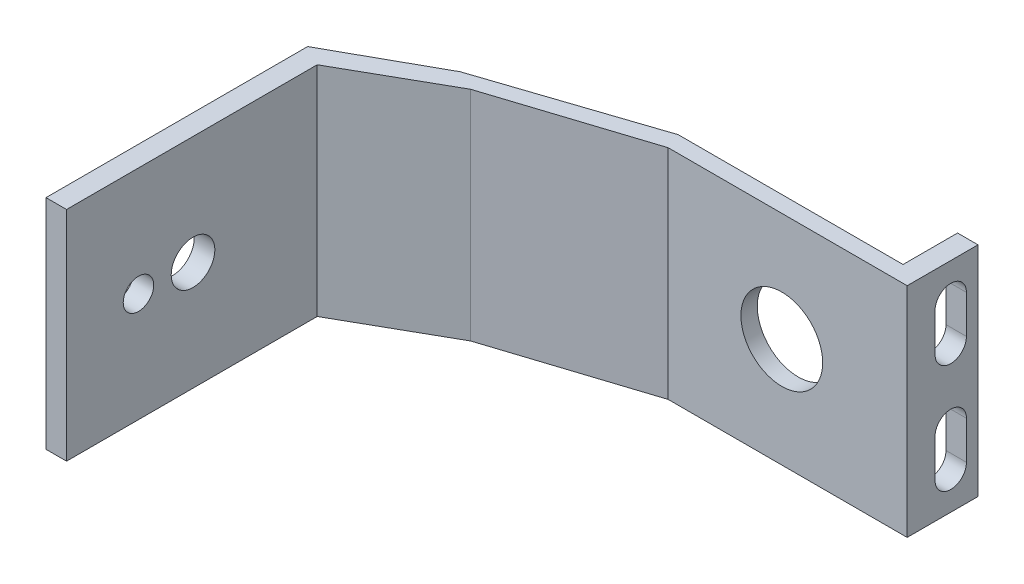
ISO-10303-21;
HEADER;
FILE_DESCRIPTION(('STEP AP214'),'2;1');
FILE_NAME('part.step','',(''),(''),'','','');
FILE_SCHEMA(('AUTOMOTIVE_DESIGN { 1 0 10303 214 1 1 1 1 }'));
ENDSEC;
DATA;
#1=APPLICATION_CONTEXT('core data for automotive mechanical design processes');
#2=APPLICATION_PROTOCOL_DEFINITION('international standard','automotive_design',2000,#1);
#3=PRODUCT_CONTEXT('',#1,'mechanical');
#4=PRODUCT('Part','Part','',(#3));
#5=PRODUCT_RELATED_PRODUCT_CATEGORY('part','',(#4));
#6=PRODUCT_DEFINITION_FORMATION('','',#4);
#7=PRODUCT_DEFINITION_CONTEXT('part definition',#1,'design');
#8=PRODUCT_DEFINITION('design','',#6,#7);
#9=PRODUCT_DEFINITION_SHAPE('','',#8);
#10=(LENGTH_UNIT() NAMED_UNIT(*) SI_UNIT(.MILLI.,.METRE.));
#11=(NAMED_UNIT(*) PLANE_ANGLE_UNIT() SI_UNIT($,.RADIAN.));
#12=(NAMED_UNIT(*) SI_UNIT($,.STERADIAN.) SOLID_ANGLE_UNIT());
#13=UNCERTAINTY_MEASURE_WITH_UNIT(LENGTH_MEASURE(1.E-05),#10,'distance_accuracy_value','');
#14=(GEOMETRIC_REPRESENTATION_CONTEXT(3) GLOBAL_UNCERTAINTY_ASSIGNED_CONTEXT((#13)) GLOBAL_UNIT_ASSIGNED_CONTEXT((#10,
#11,#12)) REPRESENTATION_CONTEXT('',''));
#15=CARTESIAN_POINT('',(0.,0.,0.));
#16=DIRECTION('',(0.,0.,1.));
#17=DIRECTION('',(1.,0.,0.));
#18=AXIS2_PLACEMENT_3D('',#15,#16,#17);
#19=CARTESIAN_POINT('',(0.,25.4,0.));
#20=DIRECTION('',(0.,0.,-1.));
#21=DIRECTION('',(-1.,0.,0.));
#22=AXIS2_PLACEMENT_3D('',#19,#20,#21);
#23=PLANE('',#22);
#24=DIRECTION('',(1.,0.,0.));
#25=VECTOR('',#24,1.);
#26=CARTESIAN_POINT('',(0.,0.,0.));
#27=LINE('',#26,#25);
#28=CARTESIAN_POINT('',(0.,0.,0.));
#29=VERTEX_POINT('',#28);
#30=CARTESIAN_POINT('',(2.39397215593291,0.,0.));
#31=VERTEX_POINT('',#30);
#32=EDGE_CURVE('E245',#29,#31,#27,.T.);
#33=ORIENTED_EDGE('',*,*,#32,.T.);
#34=DIRECTION('',(0.,-1.,0.));
#35=VECTOR('',#34,1.);
#36=CARTESIAN_POINT('',(2.39397215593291,25.4,0.));
#37=LINE('',#36,#35);
#38=CARTESIAN_POINT('',(2.39397215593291,25.4,0.));
#39=VERTEX_POINT('',#38);
#40=EDGE_CURVE('E11',#39,#31,#37,.T.);
#41=ORIENTED_EDGE('',*,*,#40,.F.);
#42=DIRECTION('',(1.,0.,0.));
#43=VECTOR('',#42,1.);
#44=CARTESIAN_POINT('',(0.,25.4,0.));
#45=LINE('',#44,#43);
#46=CARTESIAN_POINT('',(0.,25.4,0.));
#47=VERTEX_POINT('',#46);
#48=EDGE_CURVE('E271',#47,#39,#45,.T.);
#49=ORIENTED_EDGE('',*,*,#48,.F.);
#50=DIRECTION('',(0.,-1.,0.));
#51=VECTOR('',#50,1.);
#52=CARTESIAN_POINT('',(0.,25.4,0.));
#53=LINE('',#52,#51);
#54=EDGE_CURVE('E296',#47,#29,#53,.T.);
#55=ORIENTED_EDGE('',*,*,#54,.T.);
#56=EDGE_LOOP('',(#33,#41,#49,#55));
#57=FACE_BOUND('',#56,.T.);
#58=ADVANCED_FACE('F35',(#57),#23,.F.);
#59=CARTESIAN_POINT('',(2.39397215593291,25.4,0.));
#60=DIRECTION('',(-1.,0.,0.));
#61=DIRECTION('',(0.,0.,1.));
#62=AXIS2_PLACEMENT_3D('',#59,#60,#61);
#63=PLANE('',#62);
#64=CARTESIAN_POINT('',(2.39397215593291,12.7,-8.382));
#65=DIRECTION('',(-1.,0.,0.));
#66=DIRECTION('',(0.,0.,1.));
#67=AXIS2_PLACEMENT_3D('',#64,#65,#66);
#68=CIRCLE('',#67,1.778);
#69=CARTESIAN_POINT('',(2.39397215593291,12.7,-6.604));
#70=VERTEX_POINT('',#69);
#71=EDGE_CURVE('E606',#70,#70,#68,.T.);
#72=ORIENTED_EDGE('',*,*,#71,.T.);
#73=EDGE_LOOP('',(#72));
#74=FACE_BOUND('',#73,.T.);
#75=CARTESIAN_POINT('',(2.39397215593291,12.7,-14.732));
#76=DIRECTION('',(-1.,0.,0.));
#77=DIRECTION('',(0.,0.,1.));
#78=AXIS2_PLACEMENT_3D('',#75,#76,#77);
#79=CIRCLE('',#78,2.54);
#80=CARTESIAN_POINT('',(2.39397215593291,12.7,-12.192));
#81=VERTEX_POINT('',#80);
#82=EDGE_CURVE('E610',#81,#81,#79,.T.);
#83=ORIENTED_EDGE('',*,*,#82,.T.);
#84=EDGE_LOOP('',(#83));
#85=FACE_BOUND('',#84,.T.);
#86=DIRECTION('',(0.,0.,-1.));
#87=VECTOR('',#86,1.);
#88=CARTESIAN_POINT('',(2.39397215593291,0.,0.));
#89=LINE('',#88,#87);
#90=CARTESIAN_POINT('',(2.39397215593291,0.,-29.202694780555));
#91=VERTEX_POINT('',#90);
#92=EDGE_CURVE('E248',#31,#91,#89,.T.);
#93=ORIENTED_EDGE('',*,*,#92,.T.);
#94=DIRECTION('',(0.,-1.,0.));
#95=VECTOR('',#94,1.);
#96=CARTESIAN_POINT('',(2.39397215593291,25.4,-29.202694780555));
#97=LINE('',#96,#95);
#98=CARTESIAN_POINT('',(2.39397215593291,25.4,-29.202694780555));
#99=VERTEX_POINT('',#98);
#100=EDGE_CURVE('E42',#99,#91,#97,.T.);
#101=ORIENTED_EDGE('',*,*,#100,.F.);
#102=DIRECTION('',(0.,0.,-1.));
#103=VECTOR('',#102,1.);
#104=CARTESIAN_POINT('',(2.39397215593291,25.4,0.));
#105=LINE('',#104,#103);
#106=EDGE_CURVE('E274',#39,#99,#105,.T.);
#107=ORIENTED_EDGE('',*,*,#106,.F.);
#108=ORIENTED_EDGE('',*,*,#40,.T.);
#109=EDGE_LOOP('',(#93,#101,#107,#108));
#110=FACE_BOUND('',#109,.T.);
#111=ADVANCED_FACE('F352',(#74,#85,#110),#63,.F.);
#112=CARTESIAN_POINT('',(2.39397215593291,25.4,-29.202694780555));
#113=DIRECTION('',(-0.49301257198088,0.,-0.870022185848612));
#114=DIRECTION('',(-0.870022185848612,0.,0.49301257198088));
#115=AXIS2_PLACEMENT_3D('',#112,#113,#114);
#116=PLANE('',#115);
#117=DIRECTION('',(0.870022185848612,0.,-0.49301257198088));
#118=VECTOR('',#117,1.);
#119=CARTESIAN_POINT('',(2.39397215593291,0.,-29.202694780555));
#120=LINE('',#119,#118);
#121=CARTESIAN_POINT('',(13.8036061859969,0.,-35.6681540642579));
#122=VERTEX_POINT('',#121);
#123=EDGE_CURVE('E250',#91,#122,#120,.T.);
#124=ORIENTED_EDGE('',*,*,#123,.T.);
#125=DIRECTION('',(0.,-1.,0.));
#126=VECTOR('',#125,1.);
#127=CARTESIAN_POINT('',(13.8036061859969,25.4,-35.6681540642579));
#128=LINE('',#127,#126);
#129=CARTESIAN_POINT('',(13.8036061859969,25.4,-35.6681540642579));
#130=VERTEX_POINT('',#129);
#131=EDGE_CURVE('E323',#130,#122,#128,.T.);
#132=ORIENTED_EDGE('',*,*,#131,.F.);
#133=DIRECTION('',(0.870022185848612,0.,-0.49301257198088));
#134=VECTOR('',#133,1.);
#135=CARTESIAN_POINT('',(2.39397215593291,25.4,-29.202694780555));
#136=LINE('',#135,#134);
#137=EDGE_CURVE('E276',#99,#130,#136,.T.);
#138=ORIENTED_EDGE('',*,*,#137,.F.);
#139=ORIENTED_EDGE('',*,*,#100,.T.);
#140=EDGE_LOOP('',(#124,#132,#138,#139));
#141=FACE_BOUND('',#140,.T.);
#142=ADVANCED_FACE('F330',(#141),#116,.F.);
#143=CARTESIAN_POINT('',(13.8036061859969,25.4,-35.6681540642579));
#144=DIRECTION('',(-0.306850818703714,0.,-0.951757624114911));
#145=DIRECTION('',(-0.951757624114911,0.,0.306850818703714));
#146=AXIS2_PLACEMENT_3D('',#143,#144,#145);
#147=PLANE('',#146);
#148=DIRECTION('',(0.951757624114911,0.,-0.306850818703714));
#149=VECTOR('',#148,1.);
#150=CARTESIAN_POINT('',(13.8036061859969,0.,-35.6681540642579));
#151=LINE('',#150,#149);
#152=CARTESIAN_POINT('',(31.2032980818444,0.,-41.277890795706));
#153=VERTEX_POINT('',#152);
#154=EDGE_CURVE('E252',#122,#153,#151,.T.);
#155=ORIENTED_EDGE('',*,*,#154,.T.);
#156=DIRECTION('',(0.,-1.,0.));
#157=VECTOR('',#156,1.);
#158=CARTESIAN_POINT('',(31.2032980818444,25.4,-41.277890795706));
#159=LINE('',#158,#157);
#160=CARTESIAN_POINT('',(31.2032980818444,25.4,-41.277890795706));
#161=VERTEX_POINT('',#160);
#162=EDGE_CURVE('E320',#161,#153,#159,.T.);
#163=ORIENTED_EDGE('',*,*,#162,.F.);
#164=DIRECTION('',(0.951757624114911,0.,-0.306850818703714));
#165=VECTOR('',#164,1.);
#166=CARTESIAN_POINT('',(13.8036061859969,25.4,-35.6681540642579));
#167=LINE('',#166,#165);
#168=EDGE_CURVE('E278',#130,#161,#167,.T.);
#169=ORIENTED_EDGE('',*,*,#168,.F.);
#170=ORIENTED_EDGE('',*,*,#131,.T.);
#171=EDGE_LOOP('',(#155,#163,#169,#170));
#172=FACE_BOUND('',#171,.T.);
#173=ADVANCED_FACE('F340',(#172),#147,.F.);
#174=CARTESIAN_POINT('',(59.055,25.4,-41.277890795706));
#175=DIRECTION('',(0.,0.,-1.));
#176=DIRECTION('',(-1.,0.,0.));
#177=AXIS2_PLACEMENT_3D('',#174,#175,#176);
#178=PLANE('',#177);
#179=CARTESIAN_POINT('',(44.45,12.7,-41.277890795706));
#180=DIRECTION('',(0.,0.,-1.));
#181=DIRECTION('',(-1.,0.,0.));
#182=AXIS2_PLACEMENT_3D('',#179,#180,#181);
#183=CIRCLE('',#182,4.76250000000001);
#184=CARTESIAN_POINT('',(39.6875,12.7,-41.277890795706));
#185=VERTEX_POINT('',#184);
#186=EDGE_CURVE('E242',#185,#185,#183,.T.);
#187=ORIENTED_EDGE('',*,*,#186,.T.);
#188=EDGE_LOOP('',(#187));
#189=FACE_BOUND('',#188,.T.);
#190=DIRECTION('',(1.,0.,0.));
#191=VECTOR('',#190,1.);
#192=CARTESIAN_POINT('',(59.055,0.,-41.277890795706));
#193=LINE('',#192,#191);
#194=CARTESIAN_POINT('',(59.055,0.,-41.277890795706));
#195=VERTEX_POINT('',#194);
#196=EDGE_CURVE('E254',#153,#195,#193,.T.);
#197=ORIENTED_EDGE('',*,*,#196,.T.);
#198=DIRECTION('',(0.,-1.,0.));
#199=VECTOR('',#198,1.);
#200=CARTESIAN_POINT('',(59.055,25.4,-41.277890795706));
#201=LINE('',#200,#199);
#202=CARTESIAN_POINT('',(59.055,25.4,-41.277890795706));
#203=VERTEX_POINT('',#202);
#204=EDGE_CURVE('E317',#203,#195,#201,.T.);
#205=ORIENTED_EDGE('',*,*,#204,.F.);
#206=DIRECTION('',(1.,0.,0.));
#207=VECTOR('',#206,1.);
#208=CARTESIAN_POINT('',(59.055,25.4,-41.277890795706));
#209=LINE('',#208,#207);
#210=EDGE_CURVE('E280',#161,#203,#209,.T.);
#211=ORIENTED_EDGE('',*,*,#210,.F.);
#212=ORIENTED_EDGE('',*,*,#162,.T.);
#213=EDGE_LOOP('',(#197,#205,#211,#212));
#214=FACE_BOUND('',#213,.T.);
#215=ADVANCED_FACE('F344',(#189,#214),#178,.F.);
#216=CARTESIAN_POINT('',(59.055,25.4,-43.18));
#217=DIRECTION('',(-1.,0.,0.));
#218=DIRECTION('',(0.,0.,1.));
#219=AXIS2_PLACEMENT_3D('',#216,#217,#218);
#220=PLANE('',#219);
#221=DIRECTION('',(0.,-1.,0.));
#222=VECTOR('',#221,1.);
#223=CARTESIAN_POINT('',(59.055,4.1275,-48.1838));
#224=LINE('',#223,#222);
#225=CARTESIAN_POINT('',(59.055,8.5725,-48.1838));
#226=VERTEX_POINT('',#225);
#227=CARTESIAN_POINT('',(59.055,4.1275,-48.1838));
#228=VERTEX_POINT('',#227);
#229=EDGE_CURVE('E200',#226,#228,#224,.T.);
#230=ORIENTED_EDGE('',*,*,#229,.T.);
#231=CARTESIAN_POINT('',(59.055,4.1275,-46.355));
#232=DIRECTION('',(-1.,0.,0.));
#233=DIRECTION('',(0.,0.,1.));
#234=AXIS2_PLACEMENT_3D('',#231,#232,#233);
#235=CIRCLE('',#234,1.8288);
#236=CARTESIAN_POINT('',(59.055,4.1275,-44.5262));
#237=VERTEX_POINT('',#236);
#238=EDGE_CURVE('E191',#228,#237,#235,.T.);
#239=ORIENTED_EDGE('',*,*,#238,.T.);
#240=DIRECTION('',(0.,1.,0.));
#241=VECTOR('',#240,1.);
#242=CARTESIAN_POINT('',(59.055,4.1275,-44.5262));
#243=LINE('',#242,#241);
#244=CARTESIAN_POINT('',(59.055,8.5725,-44.5262));
#245=VERTEX_POINT('',#244);
#246=EDGE_CURVE('E197',#237,#245,#243,.T.);
#247=ORIENTED_EDGE('',*,*,#246,.T.);
#248=CARTESIAN_POINT('',(59.055,8.5725,-46.355));
#249=DIRECTION('',(-1.,0.,0.));
#250=DIRECTION('',(0.,0.,1.));
#251=AXIS2_PLACEMENT_3D('',#248,#249,#250);
#252=CIRCLE('',#251,1.8288);
#253=EDGE_CURVE('E49',#245,#226,#252,.T.);
#254=ORIENTED_EDGE('',*,*,#253,.T.);
#255=EDGE_LOOP('',(#230,#239,#247,#254));
#256=FACE_BOUND('',#255,.T.);
#257=DIRECTION('',(0.,-1.,0.));
#258=VECTOR('',#257,1.);
#259=CARTESIAN_POINT('',(59.055,16.8275,-48.1838));
#260=LINE('',#259,#258);
#261=CARTESIAN_POINT('',(59.055,21.2725,-48.1838));
#262=VERTEX_POINT('',#261);
#263=CARTESIAN_POINT('',(59.055,16.8275,-48.1838));
#264=VERTEX_POINT('',#263);
#265=EDGE_CURVE('E227',#262,#264,#260,.T.);
#266=ORIENTED_EDGE('',*,*,#265,.T.);
#267=CARTESIAN_POINT('',(59.055,16.8275,-46.355));
#268=DIRECTION('',(-1.,0.,0.));
#269=DIRECTION('',(0.,0.,1.));
#270=AXIS2_PLACEMENT_3D('',#267,#268,#269);
#271=CIRCLE('',#270,1.8288);
#272=CARTESIAN_POINT('',(59.055,16.8275,-44.5262));
#273=VERTEX_POINT('',#272);
#274=EDGE_CURVE('E218',#264,#273,#271,.T.);
#275=ORIENTED_EDGE('',*,*,#274,.T.);
#276=DIRECTION('',(0.,1.,0.));
#277=VECTOR('',#276,1.);
#278=CARTESIAN_POINT('',(59.055,16.8275,-44.5262));
#279=LINE('',#278,#277);
#280=CARTESIAN_POINT('',(59.055,21.2725,-44.5262));
#281=VERTEX_POINT('',#280);
#282=EDGE_CURVE('E221',#273,#281,#279,.T.);
#283=ORIENTED_EDGE('',*,*,#282,.T.);
#284=CARTESIAN_POINT('',(59.055,21.2725,-46.355));
#285=DIRECTION('',(-1.,0.,0.));
#286=DIRECTION('',(0.,0.,1.));
#287=AXIS2_PLACEMENT_3D('',#284,#285,#286);
#288=CIRCLE('',#287,1.8288);
#289=EDGE_CURVE('E224',#281,#262,#288,.T.);
#290=ORIENTED_EDGE('',*,*,#289,.T.);
#291=EDGE_LOOP('',(#266,#275,#283,#290));
#292=FACE_BOUND('',#291,.T.);
#293=DIRECTION('',(0.,0.,-1.));
#294=VECTOR('',#293,1.);
#295=CARTESIAN_POINT('',(59.055,0.,-43.18));
#296=LINE('',#295,#294);
#297=CARTESIAN_POINT('',(59.055,0.,-49.53));
#298=VERTEX_POINT('',#297);
#299=EDGE_CURVE('E257',#195,#298,#296,.T.);
#300=ORIENTED_EDGE('',*,*,#299,.T.);
#301=DIRECTION('',(0.,-1.,0.));
#302=VECTOR('',#301,1.);
#303=CARTESIAN_POINT('',(59.055,25.4,-49.53));
#304=LINE('',#303,#302);
#305=CARTESIAN_POINT('',(59.055,25.4,-49.53));
#306=VERTEX_POINT('',#305);
#307=EDGE_CURVE('E314',#306,#298,#304,.T.);
#308=ORIENTED_EDGE('',*,*,#307,.F.);
#309=DIRECTION('',(0.,0.,-1.));
#310=VECTOR('',#309,1.);
#311=CARTESIAN_POINT('',(59.055,25.4,-43.18));
#312=LINE('',#311,#310);
#313=EDGE_CURVE('E282',#203,#306,#312,.T.);
#314=ORIENTED_EDGE('',*,*,#313,.F.);
#315=ORIENTED_EDGE('',*,*,#204,.T.);
#316=EDGE_LOOP('',(#300,#308,#314,#315));
#317=FACE_BOUND('',#316,.T.);
#318=ADVANCED_FACE('F384',(#256,#292,#317),#220,.F.);
#319=CARTESIAN_POINT('',(59.055,25.4,-49.53));
#320=DIRECTION('',(0.,0.,1.));
#321=DIRECTION('',(1.,0.,0.));
#322=AXIS2_PLACEMENT_3D('',#319,#320,#321);
#323=PLANE('',#322);
#324=DIRECTION('',(-1.,0.,0.));
#325=VECTOR('',#324,1.);
#326=CARTESIAN_POINT('',(59.055,0.,-49.53));
#327=LINE('',#326,#325);
#328=CARTESIAN_POINT('',(56.67375,0.,-49.53));
#329=VERTEX_POINT('',#328);
#330=EDGE_CURVE('E259',#298,#329,#327,.T.);
#331=ORIENTED_EDGE('',*,*,#330,.T.);
#332=DIRECTION('',(0.,-1.,0.));
#333=VECTOR('',#332,1.);
#334=CARTESIAN_POINT('',(56.67375,25.4,-49.53));
#335=LINE('',#334,#333);
#336=CARTESIAN_POINT('',(56.67375,25.4,-49.53));
#337=VERTEX_POINT('',#336);
#338=EDGE_CURVE('E311',#337,#329,#335,.T.);
#339=ORIENTED_EDGE('',*,*,#338,.F.);
#340=DIRECTION('',(-1.,0.,0.));
#341=VECTOR('',#340,1.);
#342=CARTESIAN_POINT('',(59.055,25.4,-49.53));
#343=LINE('',#342,#341);
#344=EDGE_CURVE('E284',#306,#337,#343,.T.);
#345=ORIENTED_EDGE('',*,*,#344,.F.);
#346=ORIENTED_EDGE('',*,*,#307,.T.);
#347=EDGE_LOOP('',(#331,#339,#345,#346));
#348=FACE_BOUND('',#347,.T.);
#349=ADVANCED_FACE('F382',(#348),#323,.F.);
#350=CARTESIAN_POINT('',(56.67375,25.4,-49.53));
#351=DIRECTION('',(1.,0.,0.));
#352=DIRECTION('',(0.,0.,-1.));
#353=AXIS2_PLACEMENT_3D('',#350,#351,#352);
#354=PLANE('',#353);
#355=DIRECTION('',(0.,1.,0.));
#356=VECTOR('',#355,1.);
#357=CARTESIAN_POINT('',(56.67375,4.1275,-44.5262));
#358=LINE('',#357,#356);
#359=CARTESIAN_POINT('',(56.67375,4.1275,-44.5262));
#360=VERTEX_POINT('',#359);
#361=CARTESIAN_POINT('',(56.67375,8.5725,-44.5262));
#362=VERTEX_POINT('',#361);
#363=EDGE_CURVE('E182',#360,#362,#358,.T.);
#364=ORIENTED_EDGE('',*,*,#363,.F.);
#365=CARTESIAN_POINT('',(56.67375,4.1275,-46.355));
#366=DIRECTION('',(-1.,0.,0.));
#367=DIRECTION('',(0.,0.,1.));
#368=AXIS2_PLACEMENT_3D('',#365,#366,#367);
#369=CIRCLE('',#368,1.8288);
#370=CARTESIAN_POINT('',(56.67375,4.1275,-48.1838));
#371=VERTEX_POINT('',#370);
#372=EDGE_CURVE('E57',#371,#360,#369,.T.);
#373=ORIENTED_EDGE('',*,*,#372,.F.);
#374=DIRECTION('',(0.,-1.,0.));
#375=VECTOR('',#374,1.);
#376=CARTESIAN_POINT('',(56.67375,4.1275,-48.1838));
#377=LINE('',#376,#375);
#378=CARTESIAN_POINT('',(56.67375,8.5725,-48.1838));
#379=VERTEX_POINT('',#378);
#380=EDGE_CURVE('E189',#379,#371,#377,.T.);
#381=ORIENTED_EDGE('',*,*,#380,.F.);
#382=CARTESIAN_POINT('',(56.67375,8.5725,-46.355));
#383=DIRECTION('',(-1.,0.,0.));
#384=DIRECTION('',(0.,0.,1.));
#385=AXIS2_PLACEMENT_3D('',#382,#383,#384);
#386=CIRCLE('',#385,1.8288);
#387=EDGE_CURVE('E173',#362,#379,#386,.T.);
#388=ORIENTED_EDGE('',*,*,#387,.F.);
#389=EDGE_LOOP('',(#364,#373,#381,#388));
#390=FACE_BOUND('',#389,.T.);
#391=DIRECTION('',(0.,1.,0.));
#392=VECTOR('',#391,1.);
#393=CARTESIAN_POINT('',(56.67375,16.8275,-44.5262));
#394=LINE('',#393,#392);
#395=CARTESIAN_POINT('',(56.67375,16.8275,-44.5262));
#396=VERTEX_POINT('',#395);
#397=CARTESIAN_POINT('',(56.67375,21.2725,-44.5262));
#398=VERTEX_POINT('',#397);
#399=EDGE_CURVE('E209',#396,#398,#394,.T.);
#400=ORIENTED_EDGE('',*,*,#399,.F.);
#401=CARTESIAN_POINT('',(56.67375,16.8275,-46.355));
#402=DIRECTION('',(-1.,0.,0.));
#403=DIRECTION('',(0.,0.,1.));
#404=AXIS2_PLACEMENT_3D('',#401,#402,#403);
#405=CIRCLE('',#404,1.8288);
#406=CARTESIAN_POINT('',(56.67375,16.8275,-48.1838));
#407=VERTEX_POINT('',#406);
#408=EDGE_CURVE('E205',#407,#396,#405,.T.);
#409=ORIENTED_EDGE('',*,*,#408,.F.);
#410=DIRECTION('',(0.,-1.,0.));
#411=VECTOR('',#410,1.);
#412=CARTESIAN_POINT('',(56.67375,16.8275,-48.1838));
#413=LINE('',#412,#411);
#414=CARTESIAN_POINT('',(56.67375,21.2725,-48.1838));
#415=VERTEX_POINT('',#414);
#416=EDGE_CURVE('E215',#415,#407,#413,.T.);
#417=ORIENTED_EDGE('',*,*,#416,.F.);
#418=CARTESIAN_POINT('',(56.67375,21.2725,-46.355));
#419=DIRECTION('',(-1.,0.,0.));
#420=DIRECTION('',(0.,0.,1.));
#421=AXIS2_PLACEMENT_3D('',#418,#419,#420);
#422=CIRCLE('',#421,1.8288);
#423=EDGE_CURVE('E212',#398,#415,#422,.T.);
#424=ORIENTED_EDGE('',*,*,#423,.F.);
#425=EDGE_LOOP('',(#400,#409,#417,#424));
#426=FACE_BOUND('',#425,.T.);
#427=DIRECTION('',(0.,0.,1.));
#428=VECTOR('',#427,1.);
#429=CARTESIAN_POINT('',(56.67375,0.,-49.53));
#430=LINE('',#429,#428);
#431=CARTESIAN_POINT('',(56.67375,0.,-43.18));
#432=VERTEX_POINT('',#431);
#433=EDGE_CURVE('E261',#329,#432,#430,.T.);
#434=ORIENTED_EDGE('',*,*,#433,.T.);
#435=DIRECTION('',(0.,-1.,0.));
#436=VECTOR('',#435,1.);
#437=CARTESIAN_POINT('',(56.67375,25.4,-43.18));
#438=LINE('',#437,#436);
#439=CARTESIAN_POINT('',(56.67375,25.4,-43.18));
#440=VERTEX_POINT('',#439);
#441=EDGE_CURVE('E308',#440,#432,#438,.T.);
#442=ORIENTED_EDGE('',*,*,#441,.F.);
#443=DIRECTION('',(0.,0.,1.));
#444=VECTOR('',#443,1.);
#445=CARTESIAN_POINT('',(56.67375,25.4,-49.53));
#446=LINE('',#445,#444);
#447=EDGE_CURVE('E286',#337,#440,#446,.T.);
#448=ORIENTED_EDGE('',*,*,#447,.F.);
#449=ORIENTED_EDGE('',*,*,#338,.T.);
#450=EDGE_LOOP('',(#434,#442,#448,#449));
#451=FACE_BOUND('',#450,.T.);
#452=ADVANCED_FACE('F186',(#390,#426,#451),#354,.F.);
#453=CARTESIAN_POINT('',(30.48,25.4,-43.18));
#454=DIRECTION('',(0.,0.,1.));
#455=DIRECTION('',(1.,0.,0.));
#456=AXIS2_PLACEMENT_3D('',#453,#454,#455);
#457=PLANE('',#456);
#458=CARTESIAN_POINT('',(44.45,12.7,-43.18));
#459=DIRECTION('',(0.,0.,-1.));
#460=DIRECTION('',(-1.,0.,0.));
#461=AXIS2_PLACEMENT_3D('',#458,#459,#460);
#462=CIRCLE('',#461,4.76250000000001);
#463=CARTESIAN_POINT('',(39.6875,12.7,-43.18));
#464=VERTEX_POINT('',#463);
#465=EDGE_CURVE('E233',#464,#464,#462,.T.);
#466=ORIENTED_EDGE('',*,*,#465,.F.);
#467=EDGE_LOOP('',(#466));
#468=FACE_BOUND('',#467,.T.);
#469=DIRECTION('',(-1.,0.,0.));
#470=VECTOR('',#469,1.);
#471=CARTESIAN_POINT('',(30.48,0.,-43.18));
#472=LINE('',#471,#470);
#473=CARTESIAN_POINT('',(30.48,0.,-43.18));
#474=VERTEX_POINT('',#473);
#475=EDGE_CURVE('E263',#432,#474,#472,.T.);
#476=ORIENTED_EDGE('',*,*,#475,.T.);
#477=DIRECTION('',(0.,-1.,0.));
#478=VECTOR('',#477,1.);
#479=CARTESIAN_POINT('',(30.48,25.4,-43.18));
#480=LINE('',#479,#478);
#481=CARTESIAN_POINT('',(30.48,25.4,-43.18));
#482=VERTEX_POINT('',#481);
#483=EDGE_CURVE('E305',#482,#474,#480,.T.);
#484=ORIENTED_EDGE('',*,*,#483,.F.);
#485=DIRECTION('',(-1.,0.,0.));
#486=VECTOR('',#485,1.);
#487=CARTESIAN_POINT('',(30.48,25.4,-43.18));
#488=LINE('',#487,#486);
#489=EDGE_CURVE('E288',#440,#482,#488,.T.);
#490=ORIENTED_EDGE('',*,*,#489,.F.);
#491=ORIENTED_EDGE('',*,*,#441,.T.);
#492=EDGE_LOOP('',(#476,#484,#490,#491));
#493=FACE_BOUND('',#492,.T.);
#494=ADVANCED_FACE('F374',(#468,#493),#457,.F.);
#495=CARTESIAN_POINT('',(11.43,25.4,-36.83));
#496=DIRECTION('',(0.316227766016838,0.,0.948683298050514));
#497=DIRECTION('',(0.948683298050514,0.,-0.316227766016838));
#498=AXIS2_PLACEMENT_3D('',#495,#496,#497);
#499=PLANE('',#498);
#500=DIRECTION('',(-0.948683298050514,0.,0.316227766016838));
#501=VECTOR('',#500,1.);
#502=CARTESIAN_POINT('',(11.43,0.,-36.83));
#503=LINE('',#502,#501);
#504=CARTESIAN_POINT('',(11.43,0.,-36.83));
#505=VERTEX_POINT('',#504);
#506=EDGE_CURVE('E265',#474,#505,#503,.T.);
#507=ORIENTED_EDGE('',*,*,#506,.T.);
#508=DIRECTION('',(0.,-1.,0.));
#509=VECTOR('',#508,1.);
#510=CARTESIAN_POINT('',(11.43,25.4,-36.83));
#511=LINE('',#510,#509);
#512=CARTESIAN_POINT('',(11.43,25.4,-36.83));
#513=VERTEX_POINT('',#512);
#514=EDGE_CURVE('E302',#513,#505,#511,.T.);
#515=ORIENTED_EDGE('',*,*,#514,.F.);
#516=DIRECTION('',(-0.948683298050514,0.,0.316227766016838));
#517=VECTOR('',#516,1.);
#518=CARTESIAN_POINT('',(11.43,25.4,-36.83));
#519=LINE('',#518,#517);
#520=EDGE_CURVE('E290',#482,#513,#519,.T.);
#521=ORIENTED_EDGE('',*,*,#520,.F.);
#522=ORIENTED_EDGE('',*,*,#483,.T.);
#523=EDGE_LOOP('',(#507,#515,#521,#522));
#524=FACE_BOUND('',#523,.T.);
#525=ADVANCED_FACE('F368',(#524),#499,.F.);
#526=CARTESIAN_POINT('',(11.43,25.4,-36.83));
#527=DIRECTION('',(0.485642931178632,0.,0.874157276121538));
#528=DIRECTION('',(0.874157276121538,0.,-0.485642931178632));
#529=AXIS2_PLACEMENT_3D('',#526,#527,#528);
#530=PLANE('',#529);
#531=DIRECTION('',(-0.874157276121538,0.,0.485642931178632));
#532=VECTOR('',#531,1.);
#533=CARTESIAN_POINT('',(11.43,0.,-36.83));
#534=LINE('',#533,#532);
#535=CARTESIAN_POINT('',(0.,0.,-30.48));
#536=VERTEX_POINT('',#535);
#537=EDGE_CURVE('E267',#505,#536,#534,.T.);
#538=ORIENTED_EDGE('',*,*,#537,.T.);
#539=DIRECTION('',(0.,-1.,0.));
#540=VECTOR('',#539,1.);
#541=CARTESIAN_POINT('',(0.,25.4,-30.48));
#542=LINE('',#541,#540);
#543=CARTESIAN_POINT('',(0.,25.4,-30.48));
#544=VERTEX_POINT('',#543);
#545=EDGE_CURVE('E299',#544,#536,#542,.T.);
#546=ORIENTED_EDGE('',*,*,#545,.F.);
#547=DIRECTION('',(-0.874157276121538,0.,0.485642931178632));
#548=VECTOR('',#547,1.);
#549=CARTESIAN_POINT('',(11.43,25.4,-36.83));
#550=LINE('',#549,#548);
#551=EDGE_CURVE('E292',#513,#544,#550,.T.);
#552=ORIENTED_EDGE('',*,*,#551,.F.);
#553=ORIENTED_EDGE('',*,*,#514,.T.);
#554=EDGE_LOOP('',(#538,#546,#552,#553));
#555=FACE_BOUND('',#554,.T.);
#556=ADVANCED_FACE('F364',(#555),#530,.F.);
#557=CARTESIAN_POINT('',(0.,25.4,0.));
#558=DIRECTION('',(1.,0.,0.));
#559=DIRECTION('',(0.,0.,-1.));
#560=AXIS2_PLACEMENT_3D('',#557,#558,#559);
#561=PLANE('',#560);
#562=CARTESIAN_POINT('',(0.,12.7,-8.382));
#563=DIRECTION('',(-1.,0.,0.));
#564=DIRECTION('',(0.,0.,1.));
#565=AXIS2_PLACEMENT_3D('',#562,#563,#564);
#566=CIRCLE('',#565,1.778);
#567=CARTESIAN_POINT('',(0.,12.7,-6.604));
#568=VERTEX_POINT('',#567);
#569=EDGE_CURVE('E604',#568,#568,#566,.T.);
#570=ORIENTED_EDGE('',*,*,#569,.F.);
#571=EDGE_LOOP('',(#570));
#572=FACE_BOUND('',#571,.T.);
#573=CARTESIAN_POINT('',(0.,12.7,-14.732));
#574=DIRECTION('',(-1.,0.,0.));
#575=DIRECTION('',(0.,0.,1.));
#576=AXIS2_PLACEMENT_3D('',#573,#574,#575);
#577=CIRCLE('',#576,2.54);
#578=CARTESIAN_POINT('',(0.,12.7,-12.192));
#579=VERTEX_POINT('',#578);
#580=EDGE_CURVE('E607',#579,#579,#577,.T.);
#581=ORIENTED_EDGE('',*,*,#580,.F.);
#582=EDGE_LOOP('',(#581));
#583=FACE_BOUND('',#582,.T.);
#584=DIRECTION('',(0.,0.,1.));
#585=VECTOR('',#584,1.);
#586=CARTESIAN_POINT('',(0.,0.,0.));
#587=LINE('',#586,#585);
#588=EDGE_CURVE('E269',#536,#29,#587,.T.);
#589=ORIENTED_EDGE('',*,*,#588,.T.);
#590=ORIENTED_EDGE('',*,*,#54,.F.);
#591=DIRECTION('',(0.,0.,1.));
#592=VECTOR('',#591,1.);
#593=CARTESIAN_POINT('',(0.,25.4,0.));
#594=LINE('',#593,#592);
#595=EDGE_CURVE('E294',#544,#47,#594,.T.);
#596=ORIENTED_EDGE('',*,*,#595,.F.);
#597=ORIENTED_EDGE('',*,*,#545,.T.);
#598=EDGE_LOOP('',(#589,#590,#596,#597));
#599=FACE_BOUND('',#598,.T.);
#600=ADVANCED_FACE('F359',(#572,#583,#599),#561,.F.);
#601=CARTESIAN_POINT('',(2.39397215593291,25.4,0.));
#602=DIRECTION('',(0.,1.,0.));
#603=DIRECTION('',(0.,0.,1.));
#604=AXIS2_PLACEMENT_3D('',#601,#602,#603);
#605=PLANE('',#604);
#606=ORIENTED_EDGE('',*,*,#48,.T.);
#607=ORIENTED_EDGE('',*,*,#106,.T.);
#608=ORIENTED_EDGE('',*,*,#137,.T.);
#609=ORIENTED_EDGE('',*,*,#168,.T.);
#610=ORIENTED_EDGE('',*,*,#210,.T.);
#611=ORIENTED_EDGE('',*,*,#313,.T.);
#612=ORIENTED_EDGE('',*,*,#344,.T.);
#613=ORIENTED_EDGE('',*,*,#447,.T.);
#614=ORIENTED_EDGE('',*,*,#489,.T.);
#615=ORIENTED_EDGE('',*,*,#520,.T.);
#616=ORIENTED_EDGE('',*,*,#551,.T.);
#617=ORIENTED_EDGE('',*,*,#595,.T.);
#618=EDGE_LOOP('',(#606,#607,#608,#609,#610,#611,#612,#613,#614,#615,#616,#617));
#619=FACE_BOUND('',#618,.T.);
#620=ADVANCED_FACE('F348',(#619),#605,.T.);
#621=CARTESIAN_POINT('',(2.39397215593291,0.,0.));
#622=DIRECTION('',(0.,1.,0.));
#623=DIRECTION('',(0.,0.,1.));
#624=AXIS2_PLACEMENT_3D('',#621,#622,#623);
#625=PLANE('',#624);
#626=ORIENTED_EDGE('',*,*,#32,.F.);
#627=ORIENTED_EDGE('',*,*,#588,.F.);
#628=ORIENTED_EDGE('',*,*,#537,.F.);
#629=ORIENTED_EDGE('',*,*,#506,.F.);
#630=ORIENTED_EDGE('',*,*,#475,.F.);
#631=ORIENTED_EDGE('',*,*,#433,.F.);
#632=ORIENTED_EDGE('',*,*,#330,.F.);
#633=ORIENTED_EDGE('',*,*,#299,.F.);
#634=ORIENTED_EDGE('',*,*,#196,.F.);
#635=ORIENTED_EDGE('',*,*,#154,.F.);
#636=ORIENTED_EDGE('',*,*,#123,.F.);
#637=ORIENTED_EDGE('',*,*,#92,.F.);
#638=EDGE_LOOP('',(#626,#627,#628,#629,#630,#631,#632,#633,#634,#635,#636,#637));
#639=FACE_BOUND('',#638,.T.);
#640=ADVANCED_FACE('F336',(#639),#625,.F.);
#641=CARTESIAN_POINT('',(44.45,12.7,-17.78));
#642=DIRECTION('',(0.,0.,-1.));
#643=DIRECTION('',(-1.,0.,0.));
#644=AXIS2_PLACEMENT_3D('',#641,#642,#643);
#645=CYLINDRICAL_SURFACE('',#644,4.76250000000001);
#646=ORIENTED_EDGE('',*,*,#465,.T.);
#647=EDGE_LOOP('',(#646));
#648=FACE_BOUND('',#647,.T.);
#649=ORIENTED_EDGE('',*,*,#186,.F.);
#650=EDGE_LOOP('',(#649));
#651=FACE_BOUND('',#650,.T.);
#652=ADVANCED_FACE('F442',(#648,#651),#645,.F.);
#653=CARTESIAN_POINT('',(59.055,16.8275,-46.355));
#654=DIRECTION('',(-1.,0.,0.));
#655=DIRECTION('',(0.,0.,1.));
#656=AXIS2_PLACEMENT_3D('',#653,#654,#655);
#657=CYLINDRICAL_SURFACE('',#656,1.8288);
#658=ORIENTED_EDGE('',*,*,#408,.T.);
#659=DIRECTION('',(-1.,0.,0.));
#660=VECTOR('',#659,1.);
#661=CARTESIAN_POINT('',(59.055,16.8275,-44.5262));
#662=LINE('',#661,#660);
#663=EDGE_CURVE('E230',#273,#396,#662,.T.);
#664=ORIENTED_EDGE('',*,*,#663,.F.);
#665=ORIENTED_EDGE('',*,*,#274,.F.);
#666=DIRECTION('',(-1.,0.,0.));
#667=VECTOR('',#666,1.);
#668=CARTESIAN_POINT('',(59.055,16.8275,-48.1838));
#669=LINE('',#668,#667);
#670=EDGE_CURVE('E231',#264,#407,#669,.T.);
#671=ORIENTED_EDGE('',*,*,#670,.T.);
#672=EDGE_LOOP('',(#658,#664,#665,#671));
#673=FACE_BOUND('',#672,.T.);
#674=ADVANCED_FACE('F446',(#673),#657,.F.);
#675=CARTESIAN_POINT('',(59.055,16.8275,-48.1838));
#676=DIRECTION('',(0.,0.,-1.));
#677=DIRECTION('',(-1.,0.,0.));
#678=AXIS2_PLACEMENT_3D('',#675,#676,#677);
#679=PLANE('',#678);
#680=ORIENTED_EDGE('',*,*,#416,.T.);
#681=ORIENTED_EDGE('',*,*,#670,.F.);
#682=ORIENTED_EDGE('',*,*,#265,.F.);
#683=DIRECTION('',(-1.,0.,0.));
#684=VECTOR('',#683,1.);
#685=CARTESIAN_POINT('',(59.055,21.2725,-48.1838));
#686=LINE('',#685,#684);
#687=EDGE_CURVE('E234',#262,#415,#686,.T.);
#688=ORIENTED_EDGE('',*,*,#687,.T.);
#689=EDGE_LOOP('',(#680,#681,#682,#688));
#690=FACE_BOUND('',#689,.T.);
#691=ADVANCED_FACE('F468',(#690),#679,.F.);
#692=CARTESIAN_POINT('',(59.055,21.2725,-46.355));
#693=DIRECTION('',(-1.,0.,0.));
#694=DIRECTION('',(0.,0.,1.));
#695=AXIS2_PLACEMENT_3D('',#692,#693,#694);
#696=CYLINDRICAL_SURFACE('',#695,1.8288);
#697=ORIENTED_EDGE('',*,*,#423,.T.);
#698=ORIENTED_EDGE('',*,*,#687,.F.);
#699=ORIENTED_EDGE('',*,*,#289,.F.);
#700=DIRECTION('',(-1.,0.,0.));
#701=VECTOR('',#700,1.);
#702=CARTESIAN_POINT('',(59.055,21.2725,-44.5262));
#703=LINE('',#702,#701);
#704=EDGE_CURVE('E236',#281,#398,#703,.T.);
#705=ORIENTED_EDGE('',*,*,#704,.T.);
#706=EDGE_LOOP('',(#697,#698,#699,#705));
#707=FACE_BOUND('',#706,.T.);
#708=ADVANCED_FACE('F478',(#707),#696,.F.);
#709=CARTESIAN_POINT('',(59.055,16.8275,-44.5262));
#710=DIRECTION('',(0.,0.,1.));
#711=DIRECTION('',(0.,-1.,0.));
#712=AXIS2_PLACEMENT_3D('',#709,#710,#711);
#713=PLANE('',#712);
#714=ORIENTED_EDGE('',*,*,#399,.T.);
#715=ORIENTED_EDGE('',*,*,#704,.F.);
#716=ORIENTED_EDGE('',*,*,#282,.F.);
#717=ORIENTED_EDGE('',*,*,#663,.T.);
#718=EDGE_LOOP('',(#714,#715,#716,#717));
#719=FACE_BOUND('',#718,.T.);
#720=ADVANCED_FACE('F488',(#719),#713,.F.);
#721=CARTESIAN_POINT('',(59.055,4.1275,-46.355));
#722=DIRECTION('',(-1.,0.,0.));
#723=DIRECTION('',(0.,0.,1.));
#724=AXIS2_PLACEMENT_3D('',#721,#722,#723);
#725=CYLINDRICAL_SURFACE('',#724,1.8288);
#726=ORIENTED_EDGE('',*,*,#372,.T.);
#727=DIRECTION('',(-1.,0.,0.));
#728=VECTOR('',#727,1.);
#729=CARTESIAN_POINT('',(59.055,4.1275,-44.5262));
#730=LINE('',#729,#728);
#731=EDGE_CURVE('E179',#237,#360,#730,.T.);
#732=ORIENTED_EDGE('',*,*,#731,.F.);
#733=ORIENTED_EDGE('',*,*,#238,.F.);
#734=DIRECTION('',(-1.,0.,0.));
#735=VECTOR('',#734,1.);
#736=CARTESIAN_POINT('',(59.055,4.1275,-48.1838));
#737=LINE('',#736,#735);
#738=EDGE_CURVE('E203',#228,#371,#737,.T.);
#739=ORIENTED_EDGE('',*,*,#738,.T.);
#740=EDGE_LOOP('',(#726,#732,#733,#739));
#741=FACE_BOUND('',#740,.T.);
#742=ADVANCED_FACE('F498',(#741),#725,.F.);
#743=CARTESIAN_POINT('',(59.055,4.1275,-48.1838));
#744=DIRECTION('',(0.,0.,-1.));
#745=DIRECTION('',(-1.,0.,0.));
#746=AXIS2_PLACEMENT_3D('',#743,#744,#745);
#747=PLANE('',#746);
#748=ORIENTED_EDGE('',*,*,#380,.T.);
#749=ORIENTED_EDGE('',*,*,#738,.F.);
#750=ORIENTED_EDGE('',*,*,#229,.F.);
#751=DIRECTION('',(-1.,0.,0.));
#752=VECTOR('',#751,1.);
#753=CARTESIAN_POINT('',(59.055,8.5725,-48.1838));
#754=LINE('',#753,#752);
#755=EDGE_CURVE('E178',#226,#379,#754,.T.);
#756=ORIENTED_EDGE('',*,*,#755,.T.);
#757=EDGE_LOOP('',(#748,#749,#750,#756));
#758=FACE_BOUND('',#757,.T.);
#759=ADVANCED_FACE('F508',(#758),#747,.F.);
#760=CARTESIAN_POINT('',(59.055,8.5725,-46.355));
#761=DIRECTION('',(-1.,0.,0.));
#762=DIRECTION('',(0.,0.,1.));
#763=AXIS2_PLACEMENT_3D('',#760,#761,#762);
#764=CYLINDRICAL_SURFACE('',#763,1.8288);
#765=ORIENTED_EDGE('',*,*,#387,.T.);
#766=ORIENTED_EDGE('',*,*,#755,.F.);
#767=ORIENTED_EDGE('',*,*,#253,.F.);
#768=DIRECTION('',(-1.,0.,0.));
#769=VECTOR('',#768,1.);
#770=CARTESIAN_POINT('',(59.055,8.5725,-44.5262));
#771=LINE('',#770,#769);
#772=EDGE_CURVE('E169',#245,#362,#771,.T.);
#773=ORIENTED_EDGE('',*,*,#772,.T.);
#774=EDGE_LOOP('',(#765,#766,#767,#773));
#775=FACE_BOUND('',#774,.T.);
#776=ADVANCED_FACE('F171',(#775),#764,.F.);
#777=CARTESIAN_POINT('',(59.055,4.1275,-44.5262));
#778=DIRECTION('',(0.,0.,1.));
#779=DIRECTION('',(1.,0.,0.));
#780=AXIS2_PLACEMENT_3D('',#777,#778,#779);
#781=PLANE('',#780);
#782=ORIENTED_EDGE('',*,*,#363,.T.);
#783=ORIENTED_EDGE('',*,*,#772,.F.);
#784=ORIENTED_EDGE('',*,*,#246,.F.);
#785=ORIENTED_EDGE('',*,*,#731,.T.);
#786=EDGE_LOOP('',(#782,#783,#784,#785));
#787=FACE_BOUND('',#786,.T.);
#788=ADVANCED_FACE('F183',(#787),#781,.F.);
#789=CARTESIAN_POINT('',(59.055,12.7,-14.732));
#790=DIRECTION('',(-1.,0.,0.));
#791=DIRECTION('',(0.,0.,1.));
#792=AXIS2_PLACEMENT_3D('',#789,#790,#791);
#793=CYLINDRICAL_SURFACE('',#792,2.54);
#794=ORIENTED_EDGE('',*,*,#580,.T.);
#795=EDGE_LOOP('',(#794));
#796=FACE_BOUND('',#795,.T.);
#797=ORIENTED_EDGE('',*,*,#82,.F.);
#798=EDGE_LOOP('',(#797));
#799=FACE_BOUND('',#798,.T.);
#800=ADVANCED_FACE('F533',(#796,#799),#793,.F.);
#801=CARTESIAN_POINT('',(59.055,12.7,-8.382));
#802=DIRECTION('',(-1.,0.,0.));
#803=DIRECTION('',(0.,0.,1.));
#804=AXIS2_PLACEMENT_3D('',#801,#802,#803);
#805=CYLINDRICAL_SURFACE('',#804,1.778);
#806=ORIENTED_EDGE('',*,*,#569,.T.);
#807=EDGE_LOOP('',(#806));
#808=FACE_BOUND('',#807,.T.);
#809=ORIENTED_EDGE('',*,*,#71,.F.);
#810=EDGE_LOOP('',(#809));
#811=FACE_BOUND('',#810,.T.);
#812=ADVANCED_FACE('F562',(#808,#811),#805,.F.);
#813=CLOSED_SHELL('',(#58,#111,#142,#173,#215,#318,#349,#452,#494,#525,#556,#600,#620,#640,#652,
#674,#691,#708,#720,#742,#759,#776,#788,#800,#812));
#814=MANIFOLD_SOLID_BREP('B2',#813);
#815=ADVANCED_BREP_SHAPE_REPRESENTATION('',(#18,#814),#14);
#816=SHAPE_DEFINITION_REPRESENTATION(#9,#815);
ENDSEC;
END-ISO-10303-21;
